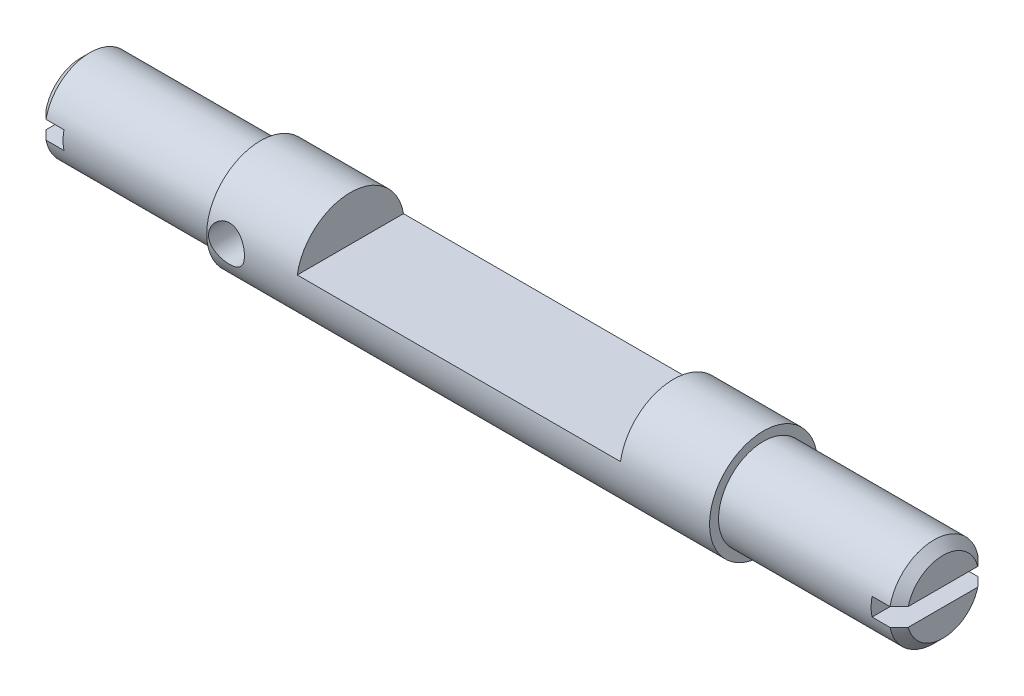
ISO-10303-21;
HEADER;
FILE_DESCRIPTION(('STEP AP214'),'2;1');
FILE_NAME('part.step','',(''),(''),'','','');
FILE_SCHEMA(('AUTOMOTIVE_DESIGN { 1 0 10303 214 1 1 1 1 }'));
ENDSEC;
DATA;
#1=APPLICATION_CONTEXT('core data for automotive mechanical design processes');
#2=APPLICATION_PROTOCOL_DEFINITION('international standard','automotive_design',2000,#1);
#3=PRODUCT_CONTEXT('',#1,'mechanical');
#4=PRODUCT('Part','Part','',(#3));
#5=PRODUCT_RELATED_PRODUCT_CATEGORY('part','',(#4));
#6=PRODUCT_DEFINITION_FORMATION('','',#4);
#7=PRODUCT_DEFINITION_CONTEXT('part definition',#1,'design');
#8=PRODUCT_DEFINITION('design','',#6,#7);
#9=PRODUCT_DEFINITION_SHAPE('','',#8);
#10=(LENGTH_UNIT() NAMED_UNIT(*) SI_UNIT(.MILLI.,.METRE.));
#11=(NAMED_UNIT(*) PLANE_ANGLE_UNIT() SI_UNIT($,.RADIAN.));
#12=(NAMED_UNIT(*) SI_UNIT($,.STERADIAN.) SOLID_ANGLE_UNIT());
#13=UNCERTAINTY_MEASURE_WITH_UNIT(LENGTH_MEASURE(1.E-05),#10,'distance_accuracy_value','');
#14=(GEOMETRIC_REPRESENTATION_CONTEXT(3) GLOBAL_UNCERTAINTY_ASSIGNED_CONTEXT((#13)) GLOBAL_UNIT_ASSIGNED_CONTEXT((#10,
#11,#12)) REPRESENTATION_CONTEXT('',''));
#15=CARTESIAN_POINT('',(0.,0.,0.));
#16=DIRECTION('',(0.,0.,1.));
#17=DIRECTION('',(1.,0.,0.));
#18=AXIS2_PLACEMENT_3D('',#15,#16,#17);
#19=CARTESIAN_POINT('',(24.,0.,0.));
#20=DIRECTION('',(-1.,0.,0.));
#21=DIRECTION('',(0.,0.,1.));
#22=AXIS2_PLACEMENT_3D('',#19,#20,#21);
#23=CONICAL_SURFACE('',#22,2.,0.785398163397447);
#24=CARTESIAN_POINT('',(23.5,0.,0.));
#25=DIRECTION('',(-1.,0.,0.));
#26=DIRECTION('',(0.,0.,1.));
#27=AXIS2_PLACEMENT_3D('',#24,#25,#26);
#28=CIRCLE('',#27,2.5);
#29=CARTESIAN_POINT('',(23.5,-0.499999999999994,-2.44948974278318));
#30=VERTEX_POINT('',#29);
#31=CARTESIAN_POINT('',(23.5,-0.499999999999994,2.44948974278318));
#32=VERTEX_POINT('',#31);
#33=EDGE_CURVE('E620',#30,#32,#28,.T.);
#34=ORIENTED_EDGE('',*,*,#33,.F.);
#35=CARTESIAN_POINT('',(20.4848373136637,-0.499999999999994,-5.49245113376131));
#36=CARTESIAN_POINT('',(20.6810151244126,-0.499999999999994,-5.29545469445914));
#37=CARTESIAN_POINT('',(20.8771564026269,-0.499999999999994,-5.09842181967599));
#38=CARTESIAN_POINT('',(21.2693295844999,-0.499999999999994,-4.70421753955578));
#39=CARTESIAN_POINT('',(21.4653614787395,-0.499999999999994,-4.50704612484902));
#40=CARTESIAN_POINT('',(21.8576041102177,-0.499999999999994,-4.11217229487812));
#41=CARTESIAN_POINT('',(22.0538145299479,-0.499999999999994,-3.91446956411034));
#42=CARTESIAN_POINT('',(22.4459461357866,-0.499999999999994,-3.51880630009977));
#43=CARTESIAN_POINT('',(22.6418673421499,-0.499999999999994,-3.32084578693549));
#44=CARTESIAN_POINT('',(23.0205064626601,-0.499999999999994,-2.93738938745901));
#45=CARTESIAN_POINT('',(23.2032529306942,-0.499999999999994,-2.75192173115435));
#46=CARTESIAN_POINT('',(23.4768542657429,-0.499999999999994,-2.47317064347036));
#47=CARTESIAN_POINT('',(23.5679784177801,-0.499999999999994,-2.38015164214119));
#48=CARTESIAN_POINT('',(23.7499680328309,-0.499999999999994,-2.19386469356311));
#49=CARTESIAN_POINT('',(23.840833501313,-0.499999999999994,-2.10059675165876));
#50=CARTESIAN_POINT('',(24.0220948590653,-0.499999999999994,-1.91379756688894));
#51=CARTESIAN_POINT('',(24.1124911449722,-0.499999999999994,-1.82026670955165));
#52=CARTESIAN_POINT('',(24.292711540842,-0.499999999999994,-1.63264043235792));
#53=CARTESIAN_POINT('',(24.3825356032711,-0.499999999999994,-1.53854496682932));
#54=CARTESIAN_POINT('',(24.5612019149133,-0.499999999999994,-1.34948902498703));
#55=CARTESIAN_POINT('',(24.6500445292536,-0.499999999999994,-1.25452889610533));
#56=CARTESIAN_POINT('',(24.7819510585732,-0.499999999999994,-1.11085234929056));
#57=CARTESIAN_POINT('',(24.8256907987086,-0.499999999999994,-1.06275735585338));
#58=CARTESIAN_POINT('',(24.9125070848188,-0.499999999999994,-0.96597348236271));
#59=CARTESIAN_POINT('',(24.9555836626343,-0.499999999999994,-0.917284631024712));
#60=CARTESIAN_POINT('',(25.021977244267,-0.499999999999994,-0.840663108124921));
#61=CARTESIAN_POINT('',(25.0456420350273,-0.499999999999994,-0.813032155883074));
#62=CARTESIAN_POINT('',(25.0925567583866,-0.499999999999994,-0.757414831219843));
#63=CARTESIAN_POINT('',(25.1158066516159,-0.499999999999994,-0.729428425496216));
#64=CARTESIAN_POINT('',(25.1620286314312,-0.499999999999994,-0.672659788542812));
#65=CARTESIAN_POINT('',(25.1849939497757,-0.499999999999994,-0.643872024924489));
#66=CARTESIAN_POINT('',(25.2301333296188,-0.499999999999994,-0.585689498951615));
#67=CARTESIAN_POINT('',(25.2523075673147,-0.499999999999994,-0.55629487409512));
#68=CARTESIAN_POINT('',(25.2958450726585,-0.499999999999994,-0.496254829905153));
#69=CARTESIAN_POINT('',(25.3171920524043,-0.499999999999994,-0.465597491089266));
#70=CARTESIAN_POINT('',(25.3581875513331,-0.499999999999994,-0.40309071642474));
#71=CARTESIAN_POINT('',(25.3778337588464,-0.499999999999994,-0.371239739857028));
#72=CARTESIAN_POINT('',(25.4141904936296,-0.499999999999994,-0.306407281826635));
#73=CARTESIAN_POINT('',(25.4309356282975,-0.499999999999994,-0.273445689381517));
#74=CARTESIAN_POINT('',(25.4601849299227,-0.499999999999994,-0.205734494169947));
#75=CARTESIAN_POINT('',(25.4727032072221,-0.499999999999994,-0.170991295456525));
#76=CARTESIAN_POINT('',(25.4906219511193,-0.499999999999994,-0.102327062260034));
#77=CARTESIAN_POINT('',(25.4964773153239,-0.499999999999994,-0.0685327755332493));
#78=CARTESIAN_POINT('',(25.501141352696,-0.499999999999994,-0.000520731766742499));
#79=CARTESIAN_POINT('',(25.4999703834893,-0.499999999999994,0.0336955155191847));
#80=CARTESIAN_POINT('',(25.4910097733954,-0.499999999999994,0.100918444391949));
#81=CARTESIAN_POINT('',(25.4832710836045,-0.499999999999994,0.133932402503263));
#82=CARTESIAN_POINT('',(25.4680210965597,-0.499999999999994,0.182318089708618));
#83=CARTESIAN_POINT('',(25.4623075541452,-0.499999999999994,0.198304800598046));
#84=CARTESIAN_POINT('',(25.449876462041,-0.499999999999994,0.229881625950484));
#85=CARTESIAN_POINT('',(25.4431591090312,-0.499999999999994,0.245471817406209));
#86=CARTESIAN_POINT('',(25.4219085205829,-0.499999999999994,0.291422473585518));
#87=CARTESIAN_POINT('',(25.4061859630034,-0.499999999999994,0.321229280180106));
#88=CARTESIAN_POINT('',(25.3726510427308,-0.499999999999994,0.379655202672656));
#89=CARTESIAN_POINT('',(25.3548361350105,-0.499999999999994,0.408272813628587));
#90=CARTESIAN_POINT('',(25.3177421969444,-0.499999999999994,0.464680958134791));
#91=CARTESIAN_POINT('',(25.2984581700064,-0.499999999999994,0.492468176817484));
#92=CARTESIAN_POINT('',(25.2589069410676,-0.499999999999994,0.547337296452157));
#93=CARTESIAN_POINT('',(25.2386395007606,-0.499999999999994,0.574419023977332));
#94=CARTESIAN_POINT('',(25.1763947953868,-0.499999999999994,0.655392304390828));
#95=CARTESIAN_POINT('',(25.1333538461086,-0.499999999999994,0.708462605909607));
#96=CARTESIAN_POINT('',(25.0458374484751,-0.499999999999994,0.813162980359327));
#97=CARTESIAN_POINT('',(25.0013657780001,-0.499999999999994,0.864796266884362));
#98=CARTESIAN_POINT('',(24.912446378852,-0.499999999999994,0.966099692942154));
#99=CARTESIAN_POINT('',(24.8680193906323,-0.499999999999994,1.01578807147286));
#100=CARTESIAN_POINT('',(24.7785560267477,-0.499999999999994,1.11461265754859));
#101=CARTESIAN_POINT('',(24.7335196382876,-0.499999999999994,1.16374885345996));
#102=CARTESIAN_POINT('',(24.5977743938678,-0.499999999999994,1.31059127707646));
#103=CARTESIAN_POINT('',(24.5064405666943,-0.499999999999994,1.40771890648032));
#104=CARTESIAN_POINT('',(24.322777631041,-0.499999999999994,1.6012439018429));
#105=CARTESIAN_POINT('',(24.2304474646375,-0.499999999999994,1.69764025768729));
#106=CARTESIAN_POINT('',(24.0452475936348,-0.499999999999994,1.8899003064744));
#107=CARTESIAN_POINT('',(23.9523779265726,-0.499999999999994,1.98576403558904));
#108=CARTESIAN_POINT('',(23.7671354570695,-0.499999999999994,2.1762746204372));
#109=CARTESIAN_POINT('',(23.6747658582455,-0.499999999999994,2.27092459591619));
#110=CARTESIAN_POINT('',(23.4897851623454,-0.499999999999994,2.4599914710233));
#111=CARTESIAN_POINT('',(23.3971740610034,-0.499999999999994,2.55440836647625));
#112=CARTESIAN_POINT('',(23.1191664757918,-0.499999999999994,2.83732988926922));
#113=CARTESIAN_POINT('',(22.9335171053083,-0.499999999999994,3.0255859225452));
#114=CARTESIAN_POINT('',(22.5603930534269,-0.499999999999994,3.4031934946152));
#115=CARTESIAN_POINT('',(22.3729154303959,-0.499999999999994,3.59254212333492));
#116=CARTESIAN_POINT('',(21.997694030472,-0.499999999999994,3.97102846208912));
#117=CARTESIAN_POINT('',(21.8099502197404,-0.499999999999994,4.16016613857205));
#118=CARTESIAN_POINT('',(21.4326954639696,-0.499999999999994,4.53990596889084));
#119=CARTESIAN_POINT('',(21.243183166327,-0.499999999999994,4.73050677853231));
#120=CARTESIAN_POINT('',(20.8640712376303,-0.499999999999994,5.1115669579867));
#121=CARTESIAN_POINT('',(20.6744716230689,-0.499999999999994,5.30202634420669));
#122=CARTESIAN_POINT('',(20.4848373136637,-0.499999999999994,5.49245113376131));
#123=B_SPLINE_CURVE_WITH_KNOTS('',3,(#35,#36,#37,#38,#39,#40,#41,#42,#43,#44,#45,#46,#47,#48,
#49,#50,#51,#52,#53,#54,#55,#56,#57,#58,#59,#60,#61,#62,#63,#64,#65,#66,#67,#68,#69,#70,#71,#72,
#73,#74,#75,#76,#77,#78,#79,#80,#81,#82,#83,#84,#85,#86,#87,#88,#89,#90,#91,#92,#93,#94,#95,#96,
#97,#98,#99,#100,#101,#102,#103,#104,#105,#106,#107,#108,#109,#110,#111,#112,#113,#114,#115,
#116,#117,#118,#119,#120,#121,#122),.UNSPECIFIED.,.F.,.F.,(4,2,2,2,2,2,2,2,2,2,2,2,2,2,2,2,2,2,
2,2,2,2,2,2,2,2,2,2,2,2,2,2,2,2,2,2,2,2,2,2,2,2,2,4),(0.,0.834050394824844,1.66816401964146,
2.50378580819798,3.33934599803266,4.12046614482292,4.51111308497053,4.90175170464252,
5.29197486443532,5.68223002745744,6.07233475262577,6.2673611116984,6.46237807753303,
6.57151456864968,6.68066136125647,6.79112918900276,6.90157225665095,7.01360660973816,
7.1257909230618,7.23652776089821,7.34689118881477,7.44915617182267,7.55112500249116,
7.65230993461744,7.70321621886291,7.75411254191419,7.85506623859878,7.9561440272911,
8.05758241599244,8.15904550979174,8.36397042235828,8.56839264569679,8.76834485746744,
8.96830127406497,9.36826411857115,9.76870439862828,10.1691171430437,10.5658745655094,
10.9626390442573,11.7558303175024,12.5552091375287,13.3547008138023,14.1610457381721,
14.9672746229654),.UNSPECIFIED.);
#124=CARTESIAN_POINT('',(24.,-0.499999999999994,-1.93649167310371));
#125=VERTEX_POINT('',#124);
#126=EDGE_CURVE('E499',#30,#125,#123,.T.);
#127=ORIENTED_EDGE('',*,*,#126,.T.);
#128=CARTESIAN_POINT('',(24.,0.,0.));
#129=DIRECTION('',(-1.,0.,0.));
#130=DIRECTION('',(0.,0.,1.));
#131=AXIS2_PLACEMENT_3D('',#128,#129,#130);
#132=CIRCLE('',#131,2.);
#133=CARTESIAN_POINT('',(24.,-0.499999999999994,1.93649167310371));
#134=VERTEX_POINT('',#133);
#135=EDGE_CURVE('E623',#125,#134,#132,.T.);
#136=ORIENTED_EDGE('',*,*,#135,.T.);
#137=EDGE_CURVE('E491',#134,#32,#123,.T.);
#138=ORIENTED_EDGE('',*,*,#137,.T.);
#139=EDGE_LOOP('',(#34,#127,#136,#138));
#140=FACE_BOUND('',#139,.T.);
#141=ADVANCED_FACE('F353',(#140),#23,.T.);
#142=CARTESIAN_POINT('',(24.,2.,0.));
#143=DIRECTION('',(-1.,0.,0.));
#144=DIRECTION('',(0.,0.,1.));
#145=AXIS2_PLACEMENT_3D('',#142,#143,#144);
#146=PLANE('',#145);
#147=ORIENTED_EDGE('',*,*,#135,.F.);
#148=DIRECTION('',(0.,0.,1.));
#149=VECTOR('',#148,1.);
#150=CARTESIAN_POINT('',(24.,-0.499999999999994,0.));
#151=LINE('',#150,#149);
#152=EDGE_CURVE('E567',#125,#134,#151,.T.);
#153=ORIENTED_EDGE('',*,*,#152,.T.);
#154=EDGE_LOOP('',(#147,#153));
#155=FACE_BOUND('',#154,.T.);
#156=ADVANCED_FACE('F656',(#155),#146,.F.);
#157=CARTESIAN_POINT('',(-24.,0.,0.));
#158=DIRECTION('',(1.,0.,0.));
#159=DIRECTION('',(0.,0.,-1.));
#160=AXIS2_PLACEMENT_3D('',#157,#158,#159);
#161=PLANE('',#160);
#162=CARTESIAN_POINT('',(-24.,0.,0.));
#163=DIRECTION('',(-1.,0.,0.));
#164=DIRECTION('',(0.,0.,1.));
#165=AXIS2_PLACEMENT_3D('',#162,#163,#164);
#166=CIRCLE('',#165,2.);
#167=CARTESIAN_POINT('',(-24.,0.5,1.93649167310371));
#168=VERTEX_POINT('',#167);
#169=CARTESIAN_POINT('',(-24.,0.5,-1.93649167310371));
#170=VERTEX_POINT('',#169);
#171=EDGE_CURVE('E599',#168,#170,#166,.T.);
#172=ORIENTED_EDGE('',*,*,#171,.T.);
#173=DIRECTION('',(0.,0.,1.));
#174=VECTOR('',#173,1.);
#175=CARTESIAN_POINT('',(-24.,0.5,-3.));
#176=LINE('',#175,#174);
#177=EDGE_CURVE('E637',#170,#168,#176,.T.);
#178=ORIENTED_EDGE('',*,*,#177,.T.);
#179=EDGE_LOOP('',(#172,#178));
#180=FACE_BOUND('',#179,.T.);
#181=ADVANCED_FACE('F636',(#180),#161,.F.);
#182=CARTESIAN_POINT('',(-23.5,0.,0.));
#183=DIRECTION('',(1.,0.,0.));
#184=DIRECTION('',(0.,0.,-1.));
#185=AXIS2_PLACEMENT_3D('',#182,#183,#184);
#186=CONICAL_SURFACE('',#185,2.5,0.785398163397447);
#187=CARTESIAN_POINT('',(-23.5,0.,0.));
#188=DIRECTION('',(-1.,0.,0.));
#189=DIRECTION('',(0.,0.,1.));
#190=AXIS2_PLACEMENT_3D('',#187,#188,#189);
#191=CIRCLE('',#190,2.5);
#192=CARTESIAN_POINT('',(-23.5,0.500000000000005,2.44948974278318));
#193=VERTEX_POINT('',#192);
#194=CARTESIAN_POINT('',(-23.5,0.500000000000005,-2.44948974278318));
#195=VERTEX_POINT('',#194);
#196=EDGE_CURVE('E603',#193,#195,#191,.T.);
#197=ORIENTED_EDGE('',*,*,#196,.T.);
#198=CARTESIAN_POINT('',(-20.4848373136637,0.499999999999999,-5.4924511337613));
#199=CARTESIAN_POINT('',(-20.6810151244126,0.499999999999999,-5.29545469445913));
#200=CARTESIAN_POINT('',(-20.8771564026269,0.5,-5.09842181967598));
#201=CARTESIAN_POINT('',(-21.2693295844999,0.5,-4.70421753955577));
#202=CARTESIAN_POINT('',(-21.4653614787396,0.5,-4.50704612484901));
#203=CARTESIAN_POINT('',(-21.8576041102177,0.5,-4.11217229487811));
#204=CARTESIAN_POINT('',(-22.053814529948,0.5,-3.91446956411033));
#205=CARTESIAN_POINT('',(-22.4459461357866,0.5,-3.51880630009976));
#206=CARTESIAN_POINT('',(-22.6418673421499,0.5,-3.32084578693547));
#207=CARTESIAN_POINT('',(-23.0205064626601,0.5,-2.93738938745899));
#208=CARTESIAN_POINT('',(-23.2032529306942,0.5,-2.75192173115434));
#209=CARTESIAN_POINT('',(-23.4768542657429,0.5,-2.47317064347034));
#210=CARTESIAN_POINT('',(-23.5679784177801,0.5,-2.38015164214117));
#211=CARTESIAN_POINT('',(-23.7499680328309,0.5,-2.1938646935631));
#212=CARTESIAN_POINT('',(-23.840833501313,0.5,-2.10059675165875));
#213=CARTESIAN_POINT('',(-24.0220948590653,0.5,-1.91379756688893));
#214=CARTESIAN_POINT('',(-24.1124911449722,0.5,-1.82026670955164));
#215=CARTESIAN_POINT('',(-24.292711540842,0.5,-1.63264043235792));
#216=CARTESIAN_POINT('',(-24.3825356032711,0.5,-1.53854496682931));
#217=CARTESIAN_POINT('',(-24.5612019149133,0.5,-1.34948902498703));
#218=CARTESIAN_POINT('',(-24.6500445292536,0.5,-1.25452889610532));
#219=CARTESIAN_POINT('',(-24.7819510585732,0.5,-1.11085234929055));
#220=CARTESIAN_POINT('',(-24.8256907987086,0.5,-1.06275735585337));
#221=CARTESIAN_POINT('',(-24.9125070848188,0.5,-0.965973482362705));
#222=CARTESIAN_POINT('',(-24.9555836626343,0.5,-0.917284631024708));
#223=CARTESIAN_POINT('',(-25.021977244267,0.5,-0.840663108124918));
#224=CARTESIAN_POINT('',(-25.0456420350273,0.5,-0.813032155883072));
#225=CARTESIAN_POINT('',(-25.0925567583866,0.5,-0.757414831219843));
#226=CARTESIAN_POINT('',(-25.1158066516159,0.5,-0.729428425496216));
#227=CARTESIAN_POINT('',(-25.1620286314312,0.5,-0.672659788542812));
#228=CARTESIAN_POINT('',(-25.1849939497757,0.5,-0.643872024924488));
#229=CARTESIAN_POINT('',(-25.2301333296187,0.5,-0.585689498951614));
#230=CARTESIAN_POINT('',(-25.2523075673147,0.5,-0.556294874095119));
#231=CARTESIAN_POINT('',(-25.2958450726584,0.5,-0.496254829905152));
#232=CARTESIAN_POINT('',(-25.3171920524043,0.5,-0.465597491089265));
#233=CARTESIAN_POINT('',(-25.3581875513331,0.5,-0.40309071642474));
#234=CARTESIAN_POINT('',(-25.3778337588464,0.5,-0.371239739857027));
#235=CARTESIAN_POINT('',(-25.4141904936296,0.5,-0.306407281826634));
#236=CARTESIAN_POINT('',(-25.4309356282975,0.5,-0.273445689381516));
#237=CARTESIAN_POINT('',(-25.4601849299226,0.5,-0.205734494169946));
#238=CARTESIAN_POINT('',(-25.472703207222,0.5,-0.170991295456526));
#239=CARTESIAN_POINT('',(-25.4906219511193,0.5,-0.102327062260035));
#240=CARTESIAN_POINT('',(-25.4964773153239,0.5,-0.0685327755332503));
#241=CARTESIAN_POINT('',(-25.501141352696,0.5,-0.000520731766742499));
#242=CARTESIAN_POINT('',(-25.4999703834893,0.5,0.0336955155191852));
#243=CARTESIAN_POINT('',(-25.4910097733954,0.5,0.100918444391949));
#244=CARTESIAN_POINT('',(-25.4832710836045,0.5,0.133932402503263));
#245=CARTESIAN_POINT('',(-25.4680210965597,0.5,0.182318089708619));
#246=CARTESIAN_POINT('',(-25.4623075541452,0.5,0.198304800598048));
#247=CARTESIAN_POINT('',(-25.4498764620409,0.5,0.229881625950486));
#248=CARTESIAN_POINT('',(-25.4431591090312,0.5,0.245471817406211));
#249=CARTESIAN_POINT('',(-25.4219085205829,0.5,0.291422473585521));
#250=CARTESIAN_POINT('',(-25.4061859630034,0.5,0.321229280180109));
#251=CARTESIAN_POINT('',(-25.3726510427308,0.5,0.379655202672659));
#252=CARTESIAN_POINT('',(-25.3548361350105,0.5,0.408272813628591));
#253=CARTESIAN_POINT('',(-25.3177421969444,0.5,0.464680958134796));
#254=CARTESIAN_POINT('',(-25.2984581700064,0.5,0.492468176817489));
#255=CARTESIAN_POINT('',(-25.2589069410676,0.5,0.547337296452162));
#256=CARTESIAN_POINT('',(-25.2386395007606,0.5,0.574419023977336));
#257=CARTESIAN_POINT('',(-25.1763947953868,0.5,0.655392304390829));
#258=CARTESIAN_POINT('',(-25.1333538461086,0.5,0.708462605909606));
#259=CARTESIAN_POINT('',(-25.0458374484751,0.5,0.813162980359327));
#260=CARTESIAN_POINT('',(-25.0013657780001,0.5,0.864796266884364));
#261=CARTESIAN_POINT('',(-24.9124463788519,0.5,0.966099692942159));
#262=CARTESIAN_POINT('',(-24.8680193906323,0.5,1.01578807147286));
#263=CARTESIAN_POINT('',(-24.7785560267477,0.5,1.1146126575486));
#264=CARTESIAN_POINT('',(-24.7335196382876,0.5,1.16374885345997));
#265=CARTESIAN_POINT('',(-24.5977743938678,0.5,1.31059127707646));
#266=CARTESIAN_POINT('',(-24.5064405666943,0.5,1.40771890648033));
#267=CARTESIAN_POINT('',(-24.322777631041,0.5,1.6012439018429));
#268=CARTESIAN_POINT('',(-24.2304474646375,0.5,1.6976402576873));
#269=CARTESIAN_POINT('',(-24.0452475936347,0.5,1.88990030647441));
#270=CARTESIAN_POINT('',(-23.9523779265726,0.5,1.98576403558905));
#271=CARTESIAN_POINT('',(-23.7671354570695,0.5,2.17627462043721));
#272=CARTESIAN_POINT('',(-23.6747658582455,0.5,2.2709245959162));
#273=CARTESIAN_POINT('',(-23.4897851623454,0.5,2.45999147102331));
#274=CARTESIAN_POINT('',(-23.3971740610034,0.5,2.55440836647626));
#275=CARTESIAN_POINT('',(-23.1191664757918,0.5,2.83732988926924));
#276=CARTESIAN_POINT('',(-22.9335171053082,0.5,3.02558592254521));
#277=CARTESIAN_POINT('',(-22.5603930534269,0.5,3.40319349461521));
#278=CARTESIAN_POINT('',(-22.3729154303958,0.5,3.59254212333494));
#279=CARTESIAN_POINT('',(-21.997694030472,0.5,3.97102846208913));
#280=CARTESIAN_POINT('',(-21.8099502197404,0.5,4.16016613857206));
#281=CARTESIAN_POINT('',(-21.4326954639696,0.5,4.53990596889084));
#282=CARTESIAN_POINT('',(-21.243183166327,0.5,4.73050677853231));
#283=CARTESIAN_POINT('',(-20.8640712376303,0.5,5.11156695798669));
#284=CARTESIAN_POINT('',(-20.6744716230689,0.499999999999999,5.30202634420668));
#285=CARTESIAN_POINT('',(-20.4848373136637,0.499999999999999,5.4924511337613));
#286=B_SPLINE_CURVE_WITH_KNOTS('',3,(#198,#199,#200,#201,#202,#203,#204,#205,#206,#207,#208,
#209,#210,#211,#212,#213,#214,#215,#216,#217,#218,#219,#220,#221,#222,#223,#224,#225,#226,#227,
#228,#229,#230,#231,#232,#233,#234,#235,#236,#237,#238,#239,#240,#241,#242,#243,#244,#245,#246,
#247,#248,#249,#250,#251,#252,#253,#254,#255,#256,#257,#258,#259,#260,#261,#262,#263,#264,#265,
#266,#267,#268,#269,#270,#271,#272,#273,#274,#275,#276,#277,#278,#279,#280,#281,#282,#283,#284,
#285),.UNSPECIFIED.,.F.,.F.,(4,2,2,2,2,2,2,2,2,2,2,2,2,2,2,2,2,2,2,2,2,2,2,2,2,2,2,2,2,2,2,2,2,
2,2,2,2,2,2,2,2,2,2,4),(0.,0.834050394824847,1.66816401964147,2.50378580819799,3.33934599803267,
4.12046614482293,4.51111308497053,4.90175170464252,5.29197486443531,5.68223002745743,
6.07233475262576,6.26736111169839,6.46237807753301,6.57151456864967,6.68066136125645,
6.79112918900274,6.90157225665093,7.01360660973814,7.12579092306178,7.23652776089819,
7.34689118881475,7.44915617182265,7.55112500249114,7.65230993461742,7.70321621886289,
7.75411254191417,7.85506623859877,7.95614402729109,8.05758241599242,8.15904550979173,
8.36397042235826,8.56839264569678,8.76834485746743,8.96830127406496,9.36826411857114,
9.76870439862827,10.1691171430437,10.5658745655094,10.9626390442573,11.7558303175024,
12.5552091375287,13.3547008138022,14.1610457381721,14.9672746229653),.UNSPECIFIED.);
#287=EDGE_CURVE('E533',#195,#170,#286,.T.);
#288=ORIENTED_EDGE('',*,*,#287,.T.);
#289=ORIENTED_EDGE('',*,*,#171,.F.);
#290=EDGE_CURVE('E526',#168,#193,#286,.T.);
#291=ORIENTED_EDGE('',*,*,#290,.T.);
#292=EDGE_LOOP('',(#197,#288,#289,#291));
#293=FACE_BOUND('',#292,.T.);
#294=ADVANCED_FACE('F548',(#293),#186,.T.);
#295=CARTESIAN_POINT('',(-24.,-0.500000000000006,-1.93649167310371));
#296=VERTEX_POINT('',#295);
#297=CARTESIAN_POINT('',(-24.,-0.500000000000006,1.93649167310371));
#298=VERTEX_POINT('',#297);
#299=EDGE_CURVE('E602',#296,#298,#166,.T.);
#300=ORIENTED_EDGE('',*,*,#299,.T.);
#301=DIRECTION('',(0.,0.,1.));
#302=VECTOR('',#301,1.);
#303=CARTESIAN_POINT('',(-24.,-0.500000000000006,-3.));
#304=LINE('',#303,#302);
#305=EDGE_CURVE('E645',#296,#298,#304,.T.);
#306=ORIENTED_EDGE('',*,*,#305,.F.);
#307=EDGE_LOOP('',(#300,#306));
#308=FACE_BOUND('',#307,.T.);
#309=ADVANCED_FACE('F355',(#308),#161,.F.);
#310=CARTESIAN_POINT('',(-23.5,-0.500000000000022,-2.44948974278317));
#311=VERTEX_POINT('',#310);
#312=CARTESIAN_POINT('',(-23.5,-0.500000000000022,2.44948974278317));
#313=VERTEX_POINT('',#312);
#314=EDGE_CURVE('E606',#311,#313,#191,.T.);
#315=ORIENTED_EDGE('',*,*,#314,.T.);
#316=CARTESIAN_POINT('',(-20.4848373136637,-0.500000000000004,5.49245113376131));
#317=CARTESIAN_POINT('',(-20.6810151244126,-0.500000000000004,5.29545469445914));
#318=CARTESIAN_POINT('',(-20.8771564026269,-0.500000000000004,5.09842181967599));
#319=CARTESIAN_POINT('',(-21.2693295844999,-0.500000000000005,4.70421753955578));
#320=CARTESIAN_POINT('',(-21.4653614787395,-0.500000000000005,4.50704612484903));
#321=CARTESIAN_POINT('',(-21.8576041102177,-0.500000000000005,4.11217229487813));
#322=CARTESIAN_POINT('',(-22.0538145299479,-0.500000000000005,3.91446956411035));
#323=CARTESIAN_POINT('',(-22.4459461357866,-0.500000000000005,3.51880630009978));
#324=CARTESIAN_POINT('',(-22.6418673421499,-0.500000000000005,3.3208457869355));
#325=CARTESIAN_POINT('',(-23.02050646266,-0.500000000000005,2.93738938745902));
#326=CARTESIAN_POINT('',(-23.2032529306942,-0.500000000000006,2.75192173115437));
#327=CARTESIAN_POINT('',(-23.4768542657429,-0.500000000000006,2.47317064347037));
#328=CARTESIAN_POINT('',(-23.5679784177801,-0.500000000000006,2.3801516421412));
#329=CARTESIAN_POINT('',(-23.7499680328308,-0.500000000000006,2.19386469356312));
#330=CARTESIAN_POINT('',(-23.840833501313,-0.500000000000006,2.10059675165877));
#331=CARTESIAN_POINT('',(-24.0220948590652,-0.500000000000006,1.91379756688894));
#332=CARTESIAN_POINT('',(-24.1124911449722,-0.500000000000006,1.82026670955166));
#333=CARTESIAN_POINT('',(-24.2927115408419,-0.500000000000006,1.63264043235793));
#334=CARTESIAN_POINT('',(-24.3825356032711,-0.500000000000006,1.53854496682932));
#335=CARTESIAN_POINT('',(-24.5612019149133,-0.500000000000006,1.34948902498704));
#336=CARTESIAN_POINT('',(-24.6500445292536,-0.500000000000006,1.25452889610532));
#337=CARTESIAN_POINT('',(-24.7819510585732,-0.500000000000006,1.11085234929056));
#338=CARTESIAN_POINT('',(-24.8256907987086,-0.500000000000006,1.06275735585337));
#339=CARTESIAN_POINT('',(-24.9125070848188,-0.500000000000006,0.965973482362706));
#340=CARTESIAN_POINT('',(-24.9555836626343,-0.500000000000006,0.917284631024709));
#341=CARTESIAN_POINT('',(-25.021977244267,-0.500000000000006,0.840663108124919));
#342=CARTESIAN_POINT('',(-25.0456420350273,-0.500000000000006,0.813032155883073));
#343=CARTESIAN_POINT('',(-25.0925567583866,-0.500000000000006,0.757414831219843));
#344=CARTESIAN_POINT('',(-25.1158066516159,-0.500000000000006,0.729428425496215));
#345=CARTESIAN_POINT('',(-25.1620286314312,-0.500000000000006,0.672659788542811));
#346=CARTESIAN_POINT('',(-25.1849939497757,-0.500000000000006,0.643872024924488));
#347=CARTESIAN_POINT('',(-25.2301333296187,-0.500000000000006,0.585689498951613));
#348=CARTESIAN_POINT('',(-25.2523075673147,-0.500000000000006,0.556294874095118));
#349=CARTESIAN_POINT('',(-25.2958450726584,-0.500000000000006,0.496254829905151));
#350=CARTESIAN_POINT('',(-25.3171920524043,-0.500000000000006,0.465597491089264));
#351=CARTESIAN_POINT('',(-25.3581875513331,-0.500000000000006,0.403090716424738));
#352=CARTESIAN_POINT('',(-25.3778337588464,-0.500000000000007,0.371239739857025));
#353=CARTESIAN_POINT('',(-25.4141904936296,-0.500000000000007,0.306407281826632));
#354=CARTESIAN_POINT('',(-25.4309356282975,-0.500000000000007,0.273445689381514));
#355=CARTESIAN_POINT('',(-25.4601849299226,-0.500000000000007,0.205734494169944));
#356=CARTESIAN_POINT('',(-25.472703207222,-0.500000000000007,0.170991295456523));
#357=CARTESIAN_POINT('',(-25.4906219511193,-0.500000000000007,0.102327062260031));
#358=CARTESIAN_POINT('',(-25.4964773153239,-0.500000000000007,0.0685327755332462));
#359=CARTESIAN_POINT('',(-25.501141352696,-0.500000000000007,0.000520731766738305));
#360=CARTESIAN_POINT('',(-25.4999703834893,-0.500000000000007,-0.0336955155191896));
#361=CARTESIAN_POINT('',(-25.4910097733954,-0.500000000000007,-0.100918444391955));
#362=CARTESIAN_POINT('',(-25.4832710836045,-0.500000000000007,-0.133932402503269));
#363=CARTESIAN_POINT('',(-25.4680210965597,-0.500000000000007,-0.182318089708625));
#364=CARTESIAN_POINT('',(-25.4623075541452,-0.500000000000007,-0.198304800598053));
#365=CARTESIAN_POINT('',(-25.4498764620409,-0.500000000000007,-0.229881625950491));
#366=CARTESIAN_POINT('',(-25.4431591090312,-0.500000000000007,-0.245471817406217));
#367=CARTESIAN_POINT('',(-25.4219085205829,-0.500000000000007,-0.291422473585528));
#368=CARTESIAN_POINT('',(-25.4061859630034,-0.500000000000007,-0.321229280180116));
#369=CARTESIAN_POINT('',(-25.3726510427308,-0.500000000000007,-0.379655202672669));
#370=CARTESIAN_POINT('',(-25.3548361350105,-0.500000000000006,-0.408272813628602));
#371=CARTESIAN_POINT('',(-25.3177421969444,-0.500000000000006,-0.46468095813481));
#372=CARTESIAN_POINT('',(-25.2984581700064,-0.500000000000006,-0.492468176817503));
#373=CARTESIAN_POINT('',(-25.2589069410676,-0.500000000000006,-0.547337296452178));
#374=CARTESIAN_POINT('',(-25.2386395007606,-0.500000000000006,-0.574419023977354));
#375=CARTESIAN_POINT('',(-25.1763947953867,-0.500000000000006,-0.65539230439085));
#376=CARTESIAN_POINT('',(-25.1333538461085,-0.500000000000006,-0.708462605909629));
#377=CARTESIAN_POINT('',(-25.0458374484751,-0.500000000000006,-0.813162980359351));
#378=CARTESIAN_POINT('',(-25.0013657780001,-0.500000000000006,-0.864796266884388));
#379=CARTESIAN_POINT('',(-24.9124463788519,-0.500000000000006,-0.966099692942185));
#380=CARTESIAN_POINT('',(-24.8680193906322,-0.500000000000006,-1.01578807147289));
#381=CARTESIAN_POINT('',(-24.7785560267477,-0.500000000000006,-1.11461265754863));
#382=CARTESIAN_POINT('',(-24.7335196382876,-0.500000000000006,-1.16374885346));
#383=CARTESIAN_POINT('',(-24.5977743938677,-0.500000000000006,-1.3105912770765));
#384=CARTESIAN_POINT('',(-24.5064405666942,-0.500000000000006,-1.40771890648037));
#385=CARTESIAN_POINT('',(-24.322777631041,-0.500000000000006,-1.60124390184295));
#386=CARTESIAN_POINT('',(-24.2304474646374,-0.500000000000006,-1.69764025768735));
#387=CARTESIAN_POINT('',(-24.0452475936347,-0.500000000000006,-1.88990030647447));
#388=CARTESIAN_POINT('',(-23.9523779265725,-0.500000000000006,-1.98576403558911));
#389=CARTESIAN_POINT('',(-23.7671354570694,-0.500000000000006,-2.17627462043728));
#390=CARTESIAN_POINT('',(-23.6747658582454,-0.500000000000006,-2.27092459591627));
#391=CARTESIAN_POINT('',(-23.4897851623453,-0.500000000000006,-2.45999147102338));
#392=CARTESIAN_POINT('',(-23.3971740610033,-0.500000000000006,-2.55440836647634));
#393=CARTESIAN_POINT('',(-23.1191664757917,-0.500000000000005,-2.83732988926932));
#394=CARTESIAN_POINT('',(-22.9335171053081,-0.500000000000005,-3.02558592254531));
#395=CARTESIAN_POINT('',(-22.5603930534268,-0.500000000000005,-3.40319349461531));
#396=CARTESIAN_POINT('',(-22.3729154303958,-0.500000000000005,-3.59254212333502));
#397=CARTESIAN_POINT('',(-21.997694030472,-0.500000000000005,-3.9710284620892));
#398=CARTESIAN_POINT('',(-21.8099502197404,-0.500000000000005,-4.16016613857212));
#399=CARTESIAN_POINT('',(-21.4326954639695,-0.500000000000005,-4.53990596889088));
#400=CARTESIAN_POINT('',(-21.243183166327,-0.500000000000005,-4.73050677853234));
#401=CARTESIAN_POINT('',(-20.8640712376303,-0.500000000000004,-5.11156695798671));
#402=CARTESIAN_POINT('',(-20.6744716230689,-0.500000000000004,-5.30202634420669));
#403=CARTESIAN_POINT('',(-20.4848373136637,-0.500000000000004,-5.4924511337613));
#404=B_SPLINE_CURVE_WITH_KNOTS('',3,(#316,#317,#318,#319,#320,#321,#322,#323,#324,#325,#326,
#327,#328,#329,#330,#331,#332,#333,#334,#335,#336,#337,#338,#339,#340,#341,#342,#343,#344,#345,
#346,#347,#348,#349,#350,#351,#352,#353,#354,#355,#356,#357,#358,#359,#360,#361,#362,#363,#364,
#365,#366,#367,#368,#369,#370,#371,#372,#373,#374,#375,#376,#377,#378,#379,#380,#381,#382,#383,
#384,#385,#386,#387,#388,#389,#390,#391,#392,#393,#394,#395,#396,#397,#398,#399,#400,#401,#402,
#403),.UNSPECIFIED.,.F.,.F.,(4,2,2,2,2,2,2,2,2,2,2,2,2,2,2,2,2,2,2,2,2,2,2,2,2,2,2,2,2,2,2,2,2,
2,2,2,2,2,2,2,2,2,2,4),(0.,0.834050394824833,1.66816401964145,2.50378580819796,3.33934599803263,
4.1204661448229,4.5111130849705,4.9017517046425,5.29197486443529,5.68223002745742,
6.07233475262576,6.26736111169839,6.46237807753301,6.57151456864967,6.68066136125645,
6.79112918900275,6.90157225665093,7.01360660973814,7.12579092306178,7.23652776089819,
7.34689118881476,7.44915617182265,7.55112500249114,7.65230993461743,7.70321621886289,
7.75411254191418,7.85506623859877,7.9561440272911,8.05758241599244,8.15904550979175,
8.36397042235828,8.56839264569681,8.76834485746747,8.968301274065,9.36826411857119,
9.76870439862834,10.1691171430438,10.5658745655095,10.9626390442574,11.7558303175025,
12.5552091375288,13.3547008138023,14.1610457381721,14.9672746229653),.UNSPECIFIED.);
#405=EDGE_CURVE('E534',#313,#298,#404,.T.);
#406=ORIENTED_EDGE('',*,*,#405,.T.);
#407=ORIENTED_EDGE('',*,*,#299,.F.);
#408=EDGE_CURVE('E535',#296,#311,#404,.T.);
#409=ORIENTED_EDGE('',*,*,#408,.T.);
#410=EDGE_LOOP('',(#315,#406,#407,#409));
#411=FACE_BOUND('',#410,.T.);
#412=ADVANCED_FACE('F542',(#411),#186,.T.);
#413=CARTESIAN_POINT('',(-61.7557939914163,0.,0.));
#414=DIRECTION('',(-1.,0.,0.));
#415=DIRECTION('',(0.,0.,1.));
#416=AXIS2_PLACEMENT_3D('',#413,#414,#415);
#417=CYLINDRICAL_SURFACE('',#416,2.5);
#418=ORIENTED_EDGE('',*,*,#196,.F.);
#419=DIRECTION('',(-1.,0.,0.));
#420=VECTOR('',#419,1.);
#421=CARTESIAN_POINT('',(-61.7557939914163,0.500000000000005,2.44948974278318));
#422=LINE('',#421,#420);
#423=CARTESIAN_POINT('',(-22.5,0.5,2.44948974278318));
#424=VERTEX_POINT('',#423);
#425=EDGE_CURVE('E572',#193,#424,#422,.F.);
#426=ORIENTED_EDGE('',*,*,#425,.T.);
#427=CARTESIAN_POINT('',(-22.5,0.,0.));
#428=DIRECTION('',(1.,0.,0.));
#429=DIRECTION('',(0.,0.,-1.));
#430=AXIS2_PLACEMENT_3D('',#427,#428,#429);
#431=CIRCLE('',#430,2.5);
#432=CARTESIAN_POINT('',(-22.5,-0.500000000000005,2.44948974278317));
#433=VERTEX_POINT('',#432);
#434=EDGE_CURVE('E575',#424,#433,#431,.T.);
#435=ORIENTED_EDGE('',*,*,#434,.T.);
#436=DIRECTION('',(-1.,0.,0.));
#437=VECTOR('',#436,1.);
#438=CARTESIAN_POINT('',(-61.7557939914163,-0.500000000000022,2.44948974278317));
#439=LINE('',#438,#437);
#440=EDGE_CURVE('E576',#433,#313,#439,.T.);
#441=ORIENTED_EDGE('',*,*,#440,.T.);
#442=ORIENTED_EDGE('',*,*,#314,.F.);
#443=DIRECTION('',(-1.,0.,0.));
#444=VECTOR('',#443,1.);
#445=CARTESIAN_POINT('',(-61.7557939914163,-0.500000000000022,-2.44948974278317));
#446=LINE('',#445,#444);
#447=CARTESIAN_POINT('',(-22.5,-0.500000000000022,-2.44948974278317));
#448=VERTEX_POINT('',#447);
#449=EDGE_CURVE('E585',#311,#448,#446,.F.);
#450=ORIENTED_EDGE('',*,*,#449,.T.);
#451=CARTESIAN_POINT('',(-22.5,0.5,-2.44948974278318));
#452=VERTEX_POINT('',#451);
#453=EDGE_CURVE('E582',#448,#452,#431,.T.);
#454=ORIENTED_EDGE('',*,*,#453,.T.);
#455=DIRECTION('',(-1.,0.,0.));
#456=VECTOR('',#455,1.);
#457=CARTESIAN_POINT('',(-61.7557939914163,0.500000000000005,-2.44948974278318));
#458=LINE('',#457,#456);
#459=EDGE_CURVE('E579',#452,#195,#458,.T.);
#460=ORIENTED_EDGE('',*,*,#459,.T.);
#461=EDGE_LOOP('',(#418,#426,#435,#441,#442,#450,#454,#460));
#462=FACE_BOUND('',#461,.T.);
#463=CARTESIAN_POINT('',(-14.,0.,0.));
#464=DIRECTION('',(-1.,0.,0.));
#465=DIRECTION('',(0.,0.,1.));
#466=AXIS2_PLACEMENT_3D('',#463,#464,#465);
#467=CIRCLE('',#466,2.5);
#468=CARTESIAN_POINT('',(-14.,0.,2.5));
#469=VERTEX_POINT('',#468);
#470=EDGE_CURVE('E607',#469,#469,#467,.T.);
#471=ORIENTED_EDGE('',*,*,#470,.T.);
#472=EDGE_LOOP('',(#471));
#473=FACE_BOUND('',#472,.T.);
#474=ADVANCED_FACE('F546',(#462,#473),#417,.T.);
#475=CARTESIAN_POINT('',(-14.,2.5,0.));
#476=DIRECTION('',(1.,0.,0.));
#477=DIRECTION('',(0.,0.,-1.));
#478=AXIS2_PLACEMENT_3D('',#475,#476,#477);
#479=PLANE('',#478);
#480=ORIENTED_EDGE('',*,*,#470,.F.);
#481=EDGE_LOOP('',(#480));
#482=FACE_BOUND('',#481,.T.);
#483=CARTESIAN_POINT('',(-14.,0.,0.));
#484=DIRECTION('',(-1.,0.,0.));
#485=DIRECTION('',(0.,0.,1.));
#486=AXIS2_PLACEMENT_3D('',#483,#484,#485);
#487=CIRCLE('',#486,3.);
#488=CARTESIAN_POINT('',(-14.,0.,3.));
#489=VERTEX_POINT('',#488);
#490=EDGE_CURVE('E610',#489,#489,#487,.T.);
#491=ORIENTED_EDGE('',*,*,#490,.T.);
#492=EDGE_LOOP('',(#491));
#493=FACE_BOUND('',#492,.T.);
#494=ADVANCED_FACE('F552',(#482,#493),#479,.F.);
#495=CARTESIAN_POINT('',(-61.7557939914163,0.,0.));
#496=DIRECTION('',(-1.,0.,0.));
#497=DIRECTION('',(0.,0.,1.));
#498=AXIS2_PLACEMENT_3D('',#495,#496,#497);
#499=CYLINDRICAL_SURFACE('',#498,3.);
#500=CARTESIAN_POINT('',(-11.9,0.,-3.));
#501=CARTESIAN_POINT('',(-11.8999997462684,0.0545633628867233,-3.00000015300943));
#502=CARTESIAN_POINT('',(-11.9044802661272,0.10912519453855,-2.99849769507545));
#503=CARTESIAN_POINT('',(-11.9222291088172,0.216641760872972,-2.99265210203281));
#504=CARTESIAN_POINT('',(-11.9354983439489,0.269596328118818,-2.98830867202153));
#505=CARTESIAN_POINT('',(-11.970319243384,0.372332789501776,-2.97725307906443));
#506=CARTESIAN_POINT('',(-11.9918570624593,0.422119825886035,-2.97054487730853));
#507=CARTESIAN_POINT('',(-12.0425411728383,0.517374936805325,-2.95544445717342));
#508=CARTESIAN_POINT('',(-12.0716889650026,0.562842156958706,-2.94705190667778));
#509=CARTESIAN_POINT('',(-12.1378258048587,0.649741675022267,-2.92914094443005));
#510=CARTESIAN_POINT('',(-12.1750312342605,0.69100370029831,-2.91959556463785));
#511=CARTESIAN_POINT('',(-12.2557671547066,0.766832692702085,-2.90060314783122));
#512=CARTESIAN_POINT('',(-12.2992990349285,0.801398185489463,-2.89115613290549));
#513=CARTESIAN_POINT('',(-12.3929851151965,0.86382494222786,-2.87313332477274));
#514=CARTESIAN_POINT('',(-12.4432937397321,0.891464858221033,-2.86459039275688));
#515=CARTESIAN_POINT('',(-12.5481760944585,0.937818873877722,-2.84975305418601));
#516=CARTESIAN_POINT('',(-12.6027485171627,0.956535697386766,-2.84345796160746));
#517=CARTESIAN_POINT('',(-12.7126732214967,0.983873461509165,-2.83411303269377));
#518=CARTESIAN_POINT('',(-12.7679372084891,0.992813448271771,-2.83096095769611));
#519=CARTESIAN_POINT('',(-12.8792637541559,1.00134112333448,-2.82795656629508));
#520=CARTESIAN_POINT('',(-12.9353260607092,1.00093170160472,-2.8281032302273));
#521=CARTESIAN_POINT('',(-13.043936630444,0.99101990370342,-2.8315901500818));
#522=CARTESIAN_POINT('',(-13.096528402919,0.981933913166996,-2.83478415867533));
#523=CARTESIAN_POINT('',(-13.1993934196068,0.955606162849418,-2.84376657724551));
#524=CARTESIAN_POINT('',(-13.2496663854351,0.938363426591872,-2.84955529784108));
#525=CARTESIAN_POINT('',(-13.3474127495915,0.895939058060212,-2.86317911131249));
#526=CARTESIAN_POINT('',(-13.3948280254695,0.870634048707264,-2.87104565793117));
#527=CARTESIAN_POINT('',(-13.4848709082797,0.812889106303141,-2.88792558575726));
#528=CARTESIAN_POINT('',(-13.5274971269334,0.780447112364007,-2.89693929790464));
#529=CARTESIAN_POINT('',(-13.6090915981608,0.707349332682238,-2.91567329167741));
#530=CARTESIAN_POINT('',(-13.6477526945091,0.666353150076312,-2.92540589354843));
#531=CARTESIAN_POINT('',(-13.7177312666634,0.578339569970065,-2.94406938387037));
#532=CARTESIAN_POINT('',(-13.7490480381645,0.531321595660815,-2.95300019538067));
#533=CARTESIAN_POINT('',(-13.8036963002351,0.431947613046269,-2.96917107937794));
#534=CARTESIAN_POINT('',(-13.8269454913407,0.379543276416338,-2.9763935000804));
#535=CARTESIAN_POINT('',(-13.8642031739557,0.271269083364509,-2.98820567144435));
#536=CARTESIAN_POINT('',(-13.8782148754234,0.215400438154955,-2.99279633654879));
#537=CARTESIAN_POINT('',(-13.8960556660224,0.104383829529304,-2.99867627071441));
#538=CARTESIAN_POINT('',(-13.9002998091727,0.0493095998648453,-3.00010001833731));
#539=CARTESIAN_POINT('',(-13.8996673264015,-0.0607750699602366,-2.99988902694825));
#540=CARTESIAN_POINT('',(-13.8947922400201,-0.115785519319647,-2.99825480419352));
#541=CARTESIAN_POINT('',(-13.876388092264,-0.22251986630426,-2.99220024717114));
#542=CARTESIAN_POINT('',(-13.8631137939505,-0.274292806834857,-2.98786198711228));
#543=CARTESIAN_POINT('',(-13.8286065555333,-0.374855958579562,-2.97691846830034));
#544=CARTESIAN_POINT('',(-13.8073726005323,-0.42364578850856,-2.97031292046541));
#545=CARTESIAN_POINT('',(-13.7569295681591,-0.518288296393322,-2.95528931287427));
#546=CARTESIAN_POINT('',(-13.7275254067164,-0.564029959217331,-2.94682814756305));
#547=CARTESIAN_POINT('',(-13.6618058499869,-0.650064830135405,-2.92905253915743));
#548=CARTESIAN_POINT('',(-13.6254883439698,-0.690356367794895,-2.91973783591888));
#549=CARTESIAN_POINT('',(-13.5450212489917,-0.766252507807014,-2.90076847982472));
#550=CARTESIAN_POINT('',(-13.5005907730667,-0.801560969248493,-2.89111761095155));
#551=CARTESIAN_POINT('',(-13.4062284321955,-0.864257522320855,-2.87299973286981));
#552=CARTESIAN_POINT('',(-13.3562965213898,-0.891645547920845,-2.8645327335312));
#553=CARTESIAN_POINT('',(-13.2523269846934,-0.937596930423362,-2.84982391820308));
#554=CARTESIAN_POINT('',(-13.1982979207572,-0.956178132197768,-2.84357760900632));
#555=CARTESIAN_POINT('',(-13.0876213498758,-0.983894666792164,-2.83410832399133));
#556=CARTESIAN_POINT('',(-13.0309750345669,-0.993034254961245,-2.83088398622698));
#557=CARTESIAN_POINT('',(-12.9198029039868,-1.00127628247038,-2.82797858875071));
#558=CARTESIAN_POINT('',(-12.8653176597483,-1.00087025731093,-2.82812400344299));
#559=CARTESIAN_POINT('',(-12.7572349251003,-0.991242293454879,-2.8315126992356));
#560=CARTESIAN_POINT('',(-12.7036373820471,-0.982020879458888,-2.83475579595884));
#561=CARTESIAN_POINT('',(-12.5998643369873,-0.955371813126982,-2.84384524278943));
#562=CARTESIAN_POINT('',(-12.5496431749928,-0.938103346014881,-2.84964098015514));
#563=CARTESIAN_POINT('',(-12.4527725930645,-0.895979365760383,-2.86316398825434));
#564=CARTESIAN_POINT('',(-12.4061239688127,-0.871122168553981,-2.87089168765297));
#565=CARTESIAN_POINT('',(-12.3155163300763,-0.813260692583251,-2.8878282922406));
#566=CARTESIAN_POINT('',(-12.2717634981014,-0.779948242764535,-2.89708711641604));
#567=CARTESIAN_POINT('',(-12.190310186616,-0.7066428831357,-2.91583356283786));
#568=CARTESIAN_POINT('',(-12.152611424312,-0.666648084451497,-2.92532124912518));
#569=CARTESIAN_POINT('',(-12.0828555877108,-0.579241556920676,-2.94390030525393));
#570=CARTESIAN_POINT('',(-12.051075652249,-0.531601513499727,-2.95296181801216));
#571=CARTESIAN_POINT('',(-11.9960095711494,-0.43135735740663,-2.96925991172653));
#572=CARTESIAN_POINT('',(-11.972721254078,-0.37875451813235,-2.97649695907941));
#573=CARTESIAN_POINT('',(-11.9362783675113,-0.272493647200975,-2.98805515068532));
#574=CARTESIAN_POINT('',(-11.9227175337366,-0.218987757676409,-2.9924921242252));
#575=CARTESIAN_POINT('',(-11.9045797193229,-0.110320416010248,-2.99846407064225));
#576=CARTESIAN_POINT('',(-11.9000002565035,-0.0551594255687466,-2.99999984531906));
#577=CARTESIAN_POINT('',(-11.9,0.,-3.));
#578=B_SPLINE_CURVE_WITH_KNOTS('',3,(#500,#501,#502,#503,#504,#505,#506,#507,#508,#509,#510,
#511,#512,#513,#514,#515,#516,#517,#518,#519,#520,#521,#522,#523,#524,#525,#526,#527,#528,#529,
#530,#531,#532,#533,#534,#535,#536,#537,#538,#539,#540,#541,#542,#543,#544,#545,#546,#547,#548,
#549,#550,#551,#552,#553,#554,#555,#556,#557,#558,#559,#560,#561,#562,#563,#564,#565,#566,#567,
#568,#569,#570,#571,#572,#573,#574,#575,#576,#577),.UNSPECIFIED.,.T.,.F.,(4,2,2,2,2,2,2,2,2,2,2,
2,2,2,2,2,2,2,2,2,2,2,2,2,2,2,2,2,2,2,2,2,2,2,2,2,2,2,4),(0.,0.163487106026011,
0.326991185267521,0.490222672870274,0.653486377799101,0.82184684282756,0.990244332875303,
1.16348384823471,1.33667044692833,1.5040192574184,1.67131633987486,1.83096826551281,
1.99063930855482,2.15288171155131,2.31517102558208,2.48593305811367,2.65671145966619,
2.82918405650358,3.00159668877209,3.1665358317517,3.33144713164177,3.49158157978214,
3.65173645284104,3.81610399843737,3.98052180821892,4.15241022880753,4.32430008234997,
4.49584013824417,4.66730284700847,4.82995666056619,4.99260079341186,5.15215587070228,
5.31174638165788,5.47830066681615,5.6449021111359,5.81799660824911,5.99104681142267,
6.15636558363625,6.32163866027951),.UNSPECIFIED.);
#579=CARTESIAN_POINT('',(-11.9,0.,-3.));
#580=VERTEX_POINT('',#579);
#581=EDGE_CURVE('E11',#580,#580,#578,.T.);
#582=ORIENTED_EDGE('',*,*,#581,.T.);
#583=EDGE_LOOP('',(#582));
#584=FACE_BOUND('',#583,.T.);
#585=CARTESIAN_POINT('',(-11.9,0.,3.));
#586=CARTESIAN_POINT('',(-11.8999997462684,-0.0545633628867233,3.00000015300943));
#587=CARTESIAN_POINT('',(-11.9044802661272,-0.10912519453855,2.99849769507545));
#588=CARTESIAN_POINT('',(-11.9222291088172,-0.216641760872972,2.99265210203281));
#589=CARTESIAN_POINT('',(-11.9354983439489,-0.269596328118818,2.98830867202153));
#590=CARTESIAN_POINT('',(-11.970319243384,-0.372332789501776,2.97725307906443));
#591=CARTESIAN_POINT('',(-11.9918570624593,-0.422119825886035,2.97054487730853));
#592=CARTESIAN_POINT('',(-12.0425411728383,-0.517374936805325,2.95544445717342));
#593=CARTESIAN_POINT('',(-12.0716889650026,-0.562842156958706,2.94705190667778));
#594=CARTESIAN_POINT('',(-12.1378258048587,-0.649741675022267,2.92914094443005));
#595=CARTESIAN_POINT('',(-12.1750312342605,-0.69100370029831,2.91959556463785));
#596=CARTESIAN_POINT('',(-12.2557671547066,-0.766832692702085,2.90060314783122));
#597=CARTESIAN_POINT('',(-12.2992990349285,-0.801398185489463,2.89115613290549));
#598=CARTESIAN_POINT('',(-12.3929851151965,-0.86382494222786,2.87313332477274));
#599=CARTESIAN_POINT('',(-12.4432937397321,-0.891464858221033,2.86459039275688));
#600=CARTESIAN_POINT('',(-12.5481760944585,-0.937818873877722,2.84975305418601));
#601=CARTESIAN_POINT('',(-12.6027485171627,-0.956535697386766,2.84345796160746));
#602=CARTESIAN_POINT('',(-12.7126732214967,-0.983873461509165,2.83411303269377));
#603=CARTESIAN_POINT('',(-12.7679372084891,-0.992813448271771,2.83096095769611));
#604=CARTESIAN_POINT('',(-12.8792637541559,-1.00134112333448,2.82795656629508));
#605=CARTESIAN_POINT('',(-12.9353260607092,-1.00093170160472,2.8281032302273));
#606=CARTESIAN_POINT('',(-13.043936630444,-0.99101990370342,2.8315901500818));
#607=CARTESIAN_POINT('',(-13.096528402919,-0.981933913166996,2.83478415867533));
#608=CARTESIAN_POINT('',(-13.1993934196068,-0.955606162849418,2.84376657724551));
#609=CARTESIAN_POINT('',(-13.2496663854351,-0.938363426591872,2.84955529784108));
#610=CARTESIAN_POINT('',(-13.3474127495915,-0.895939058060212,2.86317911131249));
#611=CARTESIAN_POINT('',(-13.3948280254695,-0.870634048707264,2.87104565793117));
#612=CARTESIAN_POINT('',(-13.4848709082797,-0.812889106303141,2.88792558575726));
#613=CARTESIAN_POINT('',(-13.5274971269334,-0.780447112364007,2.89693929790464));
#614=CARTESIAN_POINT('',(-13.6090915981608,-0.707349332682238,2.91567329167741));
#615=CARTESIAN_POINT('',(-13.6477526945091,-0.666353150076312,2.92540589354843));
#616=CARTESIAN_POINT('',(-13.7177312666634,-0.578339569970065,2.94406938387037));
#617=CARTESIAN_POINT('',(-13.7490480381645,-0.531321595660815,2.95300019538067));
#618=CARTESIAN_POINT('',(-13.8036963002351,-0.431947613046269,2.96917107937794));
#619=CARTESIAN_POINT('',(-13.8269454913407,-0.379543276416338,2.9763935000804));
#620=CARTESIAN_POINT('',(-13.8642031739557,-0.271269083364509,2.98820567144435));
#621=CARTESIAN_POINT('',(-13.8782148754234,-0.215400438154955,2.99279633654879));
#622=CARTESIAN_POINT('',(-13.8960556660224,-0.104383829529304,2.99867627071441));
#623=CARTESIAN_POINT('',(-13.9002998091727,-0.0493095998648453,3.00010001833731));
#624=CARTESIAN_POINT('',(-13.8996673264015,0.0607750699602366,2.99988902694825));
#625=CARTESIAN_POINT('',(-13.8947922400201,0.115785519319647,2.99825480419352));
#626=CARTESIAN_POINT('',(-13.876388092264,0.22251986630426,2.99220024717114));
#627=CARTESIAN_POINT('',(-13.8631137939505,0.274292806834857,2.98786198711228));
#628=CARTESIAN_POINT('',(-13.8286065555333,0.374855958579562,2.97691846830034));
#629=CARTESIAN_POINT('',(-13.8073726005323,0.42364578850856,2.97031292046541));
#630=CARTESIAN_POINT('',(-13.7569295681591,0.518288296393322,2.95528931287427));
#631=CARTESIAN_POINT('',(-13.7275254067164,0.564029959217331,2.94682814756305));
#632=CARTESIAN_POINT('',(-13.6618058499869,0.650064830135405,2.92905253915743));
#633=CARTESIAN_POINT('',(-13.6254883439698,0.690356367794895,2.91973783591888));
#634=CARTESIAN_POINT('',(-13.5450212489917,0.766252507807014,2.90076847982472));
#635=CARTESIAN_POINT('',(-13.5005907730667,0.801560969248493,2.89111761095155));
#636=CARTESIAN_POINT('',(-13.4062284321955,0.864257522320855,2.87299973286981));
#637=CARTESIAN_POINT('',(-13.3562965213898,0.891645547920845,2.8645327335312));
#638=CARTESIAN_POINT('',(-13.2523269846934,0.937596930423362,2.84982391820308));
#639=CARTESIAN_POINT('',(-13.1982979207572,0.956178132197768,2.84357760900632));
#640=CARTESIAN_POINT('',(-13.0876213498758,0.983894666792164,2.83410832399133));
#641=CARTESIAN_POINT('',(-13.0309750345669,0.993034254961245,2.83088398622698));
#642=CARTESIAN_POINT('',(-12.9198029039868,1.00127628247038,2.82797858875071));
#643=CARTESIAN_POINT('',(-12.8653176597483,1.00087025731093,2.82812400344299));
#644=CARTESIAN_POINT('',(-12.7572349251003,0.991242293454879,2.8315126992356));
#645=CARTESIAN_POINT('',(-12.7036373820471,0.982020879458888,2.83475579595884));
#646=CARTESIAN_POINT('',(-12.5998643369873,0.955371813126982,2.84384524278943));
#647=CARTESIAN_POINT('',(-12.5496431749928,0.938103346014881,2.84964098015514));
#648=CARTESIAN_POINT('',(-12.4527725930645,0.895979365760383,2.86316398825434));
#649=CARTESIAN_POINT('',(-12.4061239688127,0.871122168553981,2.87089168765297));
#650=CARTESIAN_POINT('',(-12.3155163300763,0.813260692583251,2.8878282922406));
#651=CARTESIAN_POINT('',(-12.2717634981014,0.779948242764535,2.89708711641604));
#652=CARTESIAN_POINT('',(-12.190310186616,0.7066428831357,2.91583356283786));
#653=CARTESIAN_POINT('',(-12.152611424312,0.666648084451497,2.92532124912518));
#654=CARTESIAN_POINT('',(-12.0828555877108,0.579241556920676,2.94390030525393));
#655=CARTESIAN_POINT('',(-12.051075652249,0.531601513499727,2.95296181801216));
#656=CARTESIAN_POINT('',(-11.9960095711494,0.43135735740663,2.96925991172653));
#657=CARTESIAN_POINT('',(-11.972721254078,0.37875451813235,2.97649695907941));
#658=CARTESIAN_POINT('',(-11.9362783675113,0.272493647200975,2.98805515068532));
#659=CARTESIAN_POINT('',(-11.9227175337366,0.218987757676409,2.9924921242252));
#660=CARTESIAN_POINT('',(-11.9045797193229,0.110320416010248,2.99846407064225));
#661=CARTESIAN_POINT('',(-11.9000002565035,0.0551594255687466,2.99999984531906));
#662=CARTESIAN_POINT('',(-11.9,0.,3.));
#663=B_SPLINE_CURVE_WITH_KNOTS('',3,(#585,#586,#587,#588,#589,#590,#591,#592,#593,#594,#595,
#596,#597,#598,#599,#600,#601,#602,#603,#604,#605,#606,#607,#608,#609,#610,#611,#612,#613,#614,
#615,#616,#617,#618,#619,#620,#621,#622,#623,#624,#625,#626,#627,#628,#629,#630,#631,#632,#633,
#634,#635,#636,#637,#638,#639,#640,#641,#642,#643,#644,#645,#646,#647,#648,#649,#650,#651,#652,
#653,#654,#655,#656,#657,#658,#659,#660,#661,#662),.UNSPECIFIED.,.T.,.F.,(4,2,2,2,2,2,2,2,2,2,2,
2,2,2,2,2,2,2,2,2,2,2,2,2,2,2,2,2,2,2,2,2,2,2,2,2,2,2,4),(0.,0.163487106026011,
0.326991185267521,0.490222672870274,0.653486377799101,0.82184684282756,0.990244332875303,
1.16348384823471,1.33667044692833,1.5040192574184,1.67131633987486,1.83096826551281,
1.99063930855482,2.15288171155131,2.31517102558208,2.48593305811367,2.65671145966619,
2.82918405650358,3.00159668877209,3.1665358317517,3.33144713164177,3.49158157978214,
3.65173645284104,3.81610399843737,3.98052180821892,4.15241022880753,4.32430008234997,
4.49584013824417,4.66730284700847,4.82995666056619,4.99260079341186,5.15215587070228,
5.31174638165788,5.47830066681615,5.6449021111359,5.81799660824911,5.99104681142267,
6.15636558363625,6.32163866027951),.UNSPECIFIED.);
#664=CARTESIAN_POINT('',(-11.9,0.,3.));
#665=VERTEX_POINT('',#664);
#666=EDGE_CURVE('E365',#665,#665,#663,.T.);
#667=ORIENTED_EDGE('',*,*,#666,.T.);
#668=EDGE_LOOP('',(#667));
#669=FACE_BOUND('',#668,.T.);
#670=CARTESIAN_POINT('',(8.99999999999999,0.,0.));
#671=DIRECTION('',(1.,0.,0.));
#672=DIRECTION('',(0.,0.,-1.));
#673=AXIS2_PLACEMENT_3D('',#670,#671,#672);
#674=CIRCLE('',#673,3.);
#675=CARTESIAN_POINT('',(8.99999999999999,0.5,-2.95803989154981));
#676=VERTEX_POINT('',#675);
#677=CARTESIAN_POINT('',(9.,0.5,2.95803989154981));
#678=VERTEX_POINT('',#677);
#679=EDGE_CURVE('E594',#676,#678,#674,.T.);
#680=ORIENTED_EDGE('',*,*,#679,.T.);
#681=DIRECTION('',(-1.,0.,0.));
#682=VECTOR('',#681,1.);
#683=CARTESIAN_POINT('',(-61.7557939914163,0.5,2.95803989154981));
#684=LINE('',#683,#682);
#685=CARTESIAN_POINT('',(-9.,0.5,2.95803989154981));
#686=VERTEX_POINT('',#685);
#687=EDGE_CURVE('E588',#678,#686,#684,.T.);
#688=ORIENTED_EDGE('',*,*,#687,.T.);
#689=CARTESIAN_POINT('',(-9.,0.,0.));
#690=DIRECTION('',(-1.,0.,0.));
#691=DIRECTION('',(0.,0.,1.));
#692=AXIS2_PLACEMENT_3D('',#689,#690,#691);
#693=CIRCLE('',#692,3.);
#694=CARTESIAN_POINT('',(-9.,0.5,-2.95803989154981));
#695=VERTEX_POINT('',#694);
#696=EDGE_CURVE('E591',#686,#695,#693,.T.);
#697=ORIENTED_EDGE('',*,*,#696,.T.);
#698=DIRECTION('',(-1.,0.,0.));
#699=VECTOR('',#698,1.);
#700=CARTESIAN_POINT('',(-61.7557939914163,0.5,-2.95803989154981));
#701=LINE('',#700,#699);
#702=EDGE_CURVE('E596',#695,#676,#701,.F.);
#703=ORIENTED_EDGE('',*,*,#702,.T.);
#704=EDGE_LOOP('',(#680,#688,#697,#703));
#705=FACE_BOUND('',#704,.T.);
#706=ORIENTED_EDGE('',*,*,#490,.F.);
#707=EDGE_LOOP('',(#706));
#708=FACE_BOUND('',#707,.T.);
#709=CARTESIAN_POINT('',(14.,0.,0.));
#710=DIRECTION('',(-1.,0.,0.));
#711=DIRECTION('',(0.,0.,1.));
#712=AXIS2_PLACEMENT_3D('',#709,#710,#711);
#713=CIRCLE('',#712,3.);
#714=CARTESIAN_POINT('',(14.,0.,3.));
#715=VERTEX_POINT('',#714);
#716=EDGE_CURVE('E613',#715,#715,#713,.T.);
#717=ORIENTED_EDGE('',*,*,#716,.T.);
#718=EDGE_LOOP('',(#717));
#719=FACE_BOUND('',#718,.T.);
#720=ADVANCED_FACE('F555',(#584,#669,#705,#708,#719),#499,.T.);
#721=CARTESIAN_POINT('',(14.,3.,0.));
#722=DIRECTION('',(-1.,0.,0.));
#723=DIRECTION('',(0.,0.,1.));
#724=AXIS2_PLACEMENT_3D('',#721,#722,#723);
#725=PLANE('',#724);
#726=ORIENTED_EDGE('',*,*,#716,.F.);
#727=EDGE_LOOP('',(#726));
#728=FACE_BOUND('',#727,.T.);
#729=CARTESIAN_POINT('',(14.,0.,0.));
#730=DIRECTION('',(-1.,0.,0.));
#731=DIRECTION('',(0.,0.,1.));
#732=AXIS2_PLACEMENT_3D('',#729,#730,#731);
#733=CIRCLE('',#732,2.5);
#734=CARTESIAN_POINT('',(14.,0.,2.5));
#735=VERTEX_POINT('',#734);
#736=EDGE_CURVE('E616',#735,#735,#733,.T.);
#737=ORIENTED_EDGE('',*,*,#736,.T.);
#738=EDGE_LOOP('',(#737));
#739=FACE_BOUND('',#738,.T.);
#740=ADVANCED_FACE('F560',(#728,#739),#725,.F.);
#741=CARTESIAN_POINT('',(-61.7557939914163,0.,0.));
#742=DIRECTION('',(-1.,0.,0.));
#743=DIRECTION('',(0.,0.,1.));
#744=AXIS2_PLACEMENT_3D('',#741,#742,#743);
#745=CYLINDRICAL_SURFACE('',#744,2.5);
#746=ORIENTED_EDGE('',*,*,#736,.F.);
#747=EDGE_LOOP('',(#746));
#748=FACE_BOUND('',#747,.T.);
#749=CARTESIAN_POINT('',(22.5,0.,0.));
#750=DIRECTION('',(-1.,0.,0.));
#751=DIRECTION('',(0.,0.,1.));
#752=AXIS2_PLACEMENT_3D('',#749,#750,#751);
#753=CIRCLE('',#752,2.5);
#754=CARTESIAN_POINT('',(22.5,0.499999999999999,-2.44948974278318));
#755=VERTEX_POINT('',#754);
#756=CARTESIAN_POINT('',(22.5,-0.499999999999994,-2.44948974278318));
#757=VERTEX_POINT('',#756);
#758=EDGE_CURVE('E459',#755,#757,#753,.T.);
#759=ORIENTED_EDGE('',*,*,#758,.T.);
#760=DIRECTION('',(-1.,0.,0.));
#761=VECTOR('',#760,1.);
#762=CARTESIAN_POINT('',(-61.7557939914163,-0.499999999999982,-2.44948974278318));
#763=LINE('',#762,#761);
#764=EDGE_CURVE('E643',#757,#30,#763,.F.);
#765=ORIENTED_EDGE('',*,*,#764,.T.);
#766=ORIENTED_EDGE('',*,*,#33,.T.);
#767=DIRECTION('',(-1.,0.,0.));
#768=VECTOR('',#767,1.);
#769=CARTESIAN_POINT('',(-61.7557939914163,-0.499999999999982,2.44948974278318));
#770=LINE('',#769,#768);
#771=CARTESIAN_POINT('',(22.5,-0.499999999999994,2.44948974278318));
#772=VERTEX_POINT('',#771);
#773=EDGE_CURVE('E498',#32,#772,#770,.T.);
#774=ORIENTED_EDGE('',*,*,#773,.T.);
#775=CARTESIAN_POINT('',(22.5,0.499999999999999,2.44948974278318));
#776=VERTEX_POINT('',#775);
#777=EDGE_CURVE('E469',#772,#776,#753,.T.);
#778=ORIENTED_EDGE('',*,*,#777,.T.);
#779=DIRECTION('',(-1.,0.,0.));
#780=VECTOR('',#779,1.);
#781=CARTESIAN_POINT('',(-61.7557939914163,0.499999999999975,2.44948974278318));
#782=LINE('',#781,#780);
#783=CARTESIAN_POINT('',(23.5,0.5,2.44948974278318));
#784=VERTEX_POINT('',#783);
#785=EDGE_CURVE('E474',#776,#784,#782,.F.);
#786=ORIENTED_EDGE('',*,*,#785,.T.);
#787=CARTESIAN_POINT('',(23.5,0.5,-2.44948974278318));
#788=VERTEX_POINT('',#787);
#789=EDGE_CURVE('E479',#784,#788,#28,.T.);
#790=ORIENTED_EDGE('',*,*,#789,.T.);
#791=DIRECTION('',(-1.,0.,0.));
#792=VECTOR('',#791,1.);
#793=CARTESIAN_POINT('',(-61.7557939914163,0.499999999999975,-2.44948974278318));
#794=LINE('',#793,#792);
#795=EDGE_CURVE('E472',#788,#755,#794,.T.);
#796=ORIENTED_EDGE('',*,*,#795,.T.);
#797=EDGE_LOOP('',(#759,#765,#766,#774,#778,#786,#790,#796));
#798=FACE_BOUND('',#797,.T.);
#799=ADVANCED_FACE('F477',(#748,#798),#745,.T.);
#800=ORIENTED_EDGE('',*,*,#789,.F.);
#801=CARTESIAN_POINT('',(20.4848373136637,0.499999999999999,5.49245113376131));
#802=CARTESIAN_POINT('',(20.6810151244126,0.499999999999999,5.29545469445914));
#803=CARTESIAN_POINT('',(20.8771564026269,0.499999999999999,5.09842181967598));
#804=CARTESIAN_POINT('',(21.2693295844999,0.499999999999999,4.70421753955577));
#805=CARTESIAN_POINT('',(21.4653614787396,0.499999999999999,4.50704612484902));
#806=CARTESIAN_POINT('',(21.8576041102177,0.499999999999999,4.11217229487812));
#807=CARTESIAN_POINT('',(22.053814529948,0.499999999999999,3.91446956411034));
#808=CARTESIAN_POINT('',(22.4459461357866,0.499999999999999,3.51880630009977));
#809=CARTESIAN_POINT('',(22.6418673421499,0.499999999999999,3.32084578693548));
#810=CARTESIAN_POINT('',(23.0205064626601,0.499999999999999,2.937389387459));
#811=CARTESIAN_POINT('',(23.2032529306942,0.499999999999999,2.75192173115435));
#812=CARTESIAN_POINT('',(23.4768542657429,0.5,2.47317064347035));
#813=CARTESIAN_POINT('',(23.5679784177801,0.5,2.38015164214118));
#814=CARTESIAN_POINT('',(23.7499680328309,0.5,2.19386469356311));
#815=CARTESIAN_POINT('',(23.840833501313,0.5,2.10059675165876));
#816=CARTESIAN_POINT('',(24.0220948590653,0.5,1.91379756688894));
#817=CARTESIAN_POINT('',(24.1124911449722,0.5,1.82026670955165));
#818=CARTESIAN_POINT('',(24.292711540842,0.5,1.63264043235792));
#819=CARTESIAN_POINT('',(24.3825356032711,0.5,1.53854496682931));
#820=CARTESIAN_POINT('',(24.5612019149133,0.5,1.34948902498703));
#821=CARTESIAN_POINT('',(24.6500445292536,0.5,1.25452889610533));
#822=CARTESIAN_POINT('',(24.7819510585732,0.5,1.11085234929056));
#823=CARTESIAN_POINT('',(24.8256907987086,0.5,1.06275735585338));
#824=CARTESIAN_POINT('',(24.9125070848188,0.5,0.965973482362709));
#825=CARTESIAN_POINT('',(24.9555836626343,0.5,0.917284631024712));
#826=CARTESIAN_POINT('',(25.021977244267,0.5,0.840663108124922));
#827=CARTESIAN_POINT('',(25.0456420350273,0.5,0.813032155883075));
#828=CARTESIAN_POINT('',(25.0925567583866,0.5,0.757414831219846));
#829=CARTESIAN_POINT('',(25.1158066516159,0.5,0.729428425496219));
#830=CARTESIAN_POINT('',(25.1620286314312,0.5,0.672659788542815));
#831=CARTESIAN_POINT('',(25.1849939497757,0.5,0.643872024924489));
#832=CARTESIAN_POINT('',(25.2301333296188,0.5,0.585689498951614));
#833=CARTESIAN_POINT('',(25.2523075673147,0.5,0.55629487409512));
#834=CARTESIAN_POINT('',(25.2958450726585,0.5,0.496254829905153));
#835=CARTESIAN_POINT('',(25.3171920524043,0.5,0.465597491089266));
#836=CARTESIAN_POINT('',(25.3581875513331,0.5,0.40309071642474));
#837=CARTESIAN_POINT('',(25.3778337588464,0.5,0.371239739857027));
#838=CARTESIAN_POINT('',(25.4141904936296,0.5,0.306407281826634));
#839=CARTESIAN_POINT('',(25.4309356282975,0.5,0.273445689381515));
#840=CARTESIAN_POINT('',(25.4601849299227,0.5,0.205734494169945));
#841=CARTESIAN_POINT('',(25.472703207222,0.5,0.170991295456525));
#842=CARTESIAN_POINT('',(25.4906219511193,0.5,0.102327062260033));
#843=CARTESIAN_POINT('',(25.4964773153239,0.5,0.0685327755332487));
#844=CARTESIAN_POINT('',(25.501141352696,0.5,0.000520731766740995));
#845=CARTESIAN_POINT('',(25.4999703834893,0.5,-0.0336955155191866));
#846=CARTESIAN_POINT('',(25.4910097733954,0.5,-0.100918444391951));
#847=CARTESIAN_POINT('',(25.4832710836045,0.5,-0.133932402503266));
#848=CARTESIAN_POINT('',(25.4680210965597,0.5,-0.182318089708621));
#849=CARTESIAN_POINT('',(25.4623075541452,0.5,-0.19830480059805));
#850=CARTESIAN_POINT('',(25.449876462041,0.5,-0.229881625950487));
#851=CARTESIAN_POINT('',(25.4431591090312,0.5,-0.245471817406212));
#852=CARTESIAN_POINT('',(25.4219085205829,0.5,-0.291422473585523));
#853=CARTESIAN_POINT('',(25.4061859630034,0.5,-0.321229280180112));
#854=CARTESIAN_POINT('',(25.3726510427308,0.5,-0.379655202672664));
#855=CARTESIAN_POINT('',(25.3548361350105,0.5,-0.408272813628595));
#856=CARTESIAN_POINT('',(25.3177421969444,0.5,-0.464680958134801));
#857=CARTESIAN_POINT('',(25.2984581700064,0.5,-0.492468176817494));
#858=CARTESIAN_POINT('',(25.2589069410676,0.5,-0.547337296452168));
#859=CARTESIAN_POINT('',(25.2386395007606,0.5,-0.574419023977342));
#860=CARTESIAN_POINT('',(25.1763947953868,0.5,-0.655392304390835));
#861=CARTESIAN_POINT('',(25.1333538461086,0.5,-0.708462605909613));
#862=CARTESIAN_POINT('',(25.0458374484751,0.5,-0.813162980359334));
#863=CARTESIAN_POINT('',(25.0013657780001,0.5,-0.864796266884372));
#864=CARTESIAN_POINT('',(24.9124463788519,0.5,-0.966099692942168));
#865=CARTESIAN_POINT('',(24.8680193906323,0.5,-1.01578807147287));
#866=CARTESIAN_POINT('',(24.7785560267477,0.5,-1.11461265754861));
#867=CARTESIAN_POINT('',(24.7335196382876,0.5,-1.16374885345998));
#868=CARTESIAN_POINT('',(24.5977743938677,0.5,-1.31059127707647));
#869=CARTESIAN_POINT('',(24.5064405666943,0.5,-1.40771890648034));
#870=CARTESIAN_POINT('',(24.322777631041,0.5,-1.60124390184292));
#871=CARTESIAN_POINT('',(24.2304474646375,0.5,-1.69764025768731));
#872=CARTESIAN_POINT('',(24.0452475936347,0.5,-1.88990030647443));
#873=CARTESIAN_POINT('',(23.9523779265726,0.5,-1.98576403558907));
#874=CARTESIAN_POINT('',(23.7671354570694,0.5,-2.17627462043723));
#875=CARTESIAN_POINT('',(23.6747658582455,0.5,-2.27092459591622));
#876=CARTESIAN_POINT('',(23.4897851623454,0.5,-2.45999147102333));
#877=CARTESIAN_POINT('',(23.3971740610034,0.5,-2.55440836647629));
#878=CARTESIAN_POINT('',(23.1191664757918,0.5,-2.83732988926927));
#879=CARTESIAN_POINT('',(22.9335171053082,0.499999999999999,-3.02558592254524));
#880=CARTESIAN_POINT('',(22.5603930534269,0.499999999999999,-3.40319349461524));
#881=CARTESIAN_POINT('',(22.3729154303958,0.499999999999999,-3.59254212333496));
#882=CARTESIAN_POINT('',(21.997694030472,0.499999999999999,-3.97102846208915));
#883=CARTESIAN_POINT('',(21.8099502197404,0.499999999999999,-4.16016613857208));
#884=CARTESIAN_POINT('',(21.4326954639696,0.499999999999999,-4.53990596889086));
#885=CARTESIAN_POINT('',(21.243183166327,0.499999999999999,-4.73050677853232));
#886=CARTESIAN_POINT('',(20.8640712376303,0.499999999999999,-5.1115669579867));
#887=CARTESIAN_POINT('',(20.6744716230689,0.499999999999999,-5.30202634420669));
#888=CARTESIAN_POINT('',(20.4848373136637,0.499999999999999,-5.49245113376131));
#889=B_SPLINE_CURVE_WITH_KNOTS('',3,(#801,#802,#803,#804,#805,#806,#807,#808,#809,#810,#811,
#812,#813,#814,#815,#816,#817,#818,#819,#820,#821,#822,#823,#824,#825,#826,#827,#828,#829,#830,
#831,#832,#833,#834,#835,#836,#837,#838,#839,#840,#841,#842,#843,#844,#845,#846,#847,#848,#849,
#850,#851,#852,#853,#854,#855,#856,#857,#858,#859,#860,#861,#862,#863,#864,#865,#866,#867,#868,
#869,#870,#871,#872,#873,#874,#875,#876,#877,#878,#879,#880,#881,#882,#883,#884,#885,#886,#887,
#888),.UNSPECIFIED.,.F.,.F.,(4,2,2,2,2,2,2,2,2,2,2,2,2,2,2,2,2,2,2,2,2,2,2,2,2,2,2,2,2,2,2,2,2,
2,2,2,2,2,2,2,2,2,2,4),(0.,0.834050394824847,1.66816401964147,2.50378580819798,3.33934599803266,
4.12046614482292,4.51111308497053,4.90175170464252,5.29197486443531,5.68223002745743,
6.07233475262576,6.26736111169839,6.46237807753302,6.57151456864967,6.68066136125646,
6.79112918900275,6.90157225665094,7.01360660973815,7.12579092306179,7.2365277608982,
7.34689118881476,7.44915617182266,7.55112500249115,7.65230993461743,7.7032162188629,
7.75411254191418,7.85506623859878,7.9561440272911,8.05758241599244,8.15904550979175,
8.36397042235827,8.5683926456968,8.76834485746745,8.96830127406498,9.36826411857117,
9.76870439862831,10.1691171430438,10.5658745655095,10.9626390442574,11.7558303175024,
12.5552091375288,13.3547008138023,14.1610457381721,14.9672746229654),.UNSPECIFIED.);
#890=CARTESIAN_POINT('',(24.,0.5,1.93649167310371));
#891=VERTEX_POINT('',#890);
#892=EDGE_CURVE('E480',#784,#891,#889,.T.);
#893=ORIENTED_EDGE('',*,*,#892,.T.);
#894=CARTESIAN_POINT('',(24.,0.5,-1.93649167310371));
#895=VERTEX_POINT('',#894);
#896=EDGE_CURVE('E621',#891,#895,#132,.T.);
#897=ORIENTED_EDGE('',*,*,#896,.T.);
#898=EDGE_CURVE('E372',#895,#788,#889,.T.);
#899=ORIENTED_EDGE('',*,*,#898,.T.);
#900=EDGE_LOOP('',(#800,#893,#897,#899));
#901=FACE_BOUND('',#900,.T.);
#902=ADVANCED_FACE('F501',(#901),#23,.T.);
#903=ORIENTED_EDGE('',*,*,#896,.F.);
#904=DIRECTION('',(0.,0.,-1.));
#905=VECTOR('',#904,1.);
#906=CARTESIAN_POINT('',(24.,0.5,0.));
#907=LINE('',#906,#905);
#908=EDGE_CURVE('E570',#891,#895,#907,.T.);
#909=ORIENTED_EDGE('',*,*,#908,.T.);
#910=EDGE_LOOP('',(#903,#909));
#911=FACE_BOUND('',#910,.T.);
#912=ADVANCED_FACE('F658',(#911),#146,.F.);
#913=CARTESIAN_POINT('',(-9.,3.,-3.));
#914=DIRECTION('',(-1.,0.,0.));
#915=DIRECTION('',(0.,0.,1.));
#916=AXIS2_PLACEMENT_3D('',#913,#914,#915);
#917=PLANE('',#916);
#918=DIRECTION('',(0.,0.,1.));
#919=VECTOR('',#918,1.);
#920=CARTESIAN_POINT('',(-9.,0.5,-3.));
#921=LINE('',#920,#919);
#922=EDGE_CURVE('E624',#695,#686,#921,.T.);
#923=ORIENTED_EDGE('',*,*,#922,.F.);
#924=ORIENTED_EDGE('',*,*,#696,.F.);
#925=EDGE_LOOP('',(#923,#924));
#926=FACE_BOUND('',#925,.T.);
#927=ADVANCED_FACE('F665',(#926),#917,.F.);
#928=CARTESIAN_POINT('',(9.,3.,-3.));
#929=DIRECTION('',(1.,0.,0.));
#930=DIRECTION('',(0.,0.,-1.));
#931=AXIS2_PLACEMENT_3D('',#928,#929,#930);
#932=PLANE('',#931);
#933=DIRECTION('',(0.,0.,1.));
#934=VECTOR('',#933,1.);
#935=CARTESIAN_POINT('',(9.,0.5,-3.));
#936=LINE('',#935,#934);
#937=EDGE_CURVE('E540',#676,#678,#936,.T.);
#938=ORIENTED_EDGE('',*,*,#937,.T.);
#939=ORIENTED_EDGE('',*,*,#679,.F.);
#940=EDGE_LOOP('',(#938,#939));
#941=FACE_BOUND('',#940,.T.);
#942=ADVANCED_FACE('F671',(#941),#932,.F.);
#943=CARTESIAN_POINT('',(-9.,0.5,-3.));
#944=DIRECTION('',(0.,-1.,0.));
#945=DIRECTION('',(0.,0.,-1.));
#946=AXIS2_PLACEMENT_3D('',#943,#944,#945);
#947=PLANE('',#946);
#948=ORIENTED_EDGE('',*,*,#937,.F.);
#949=ORIENTED_EDGE('',*,*,#702,.F.);
#950=ORIENTED_EDGE('',*,*,#922,.T.);
#951=ORIENTED_EDGE('',*,*,#687,.F.);
#952=EDGE_LOOP('',(#948,#949,#950,#951));
#953=FACE_BOUND('',#952,.T.);
#954=ADVANCED_FACE('F522',(#953),#947,.F.);
#955=CARTESIAN_POINT('',(-24.,0.5,-3.));
#956=DIRECTION('',(0.,1.,0.));
#957=DIRECTION('',(-1.,0.,0.));
#958=AXIS2_PLACEMENT_3D('',#955,#956,#957);
#959=PLANE('',#958);
#960=ORIENTED_EDGE('',*,*,#459,.F.);
#961=DIRECTION('',(0.,0.,1.));
#962=VECTOR('',#961,1.);
#963=CARTESIAN_POINT('',(-22.5,0.5,-3.));
#964=LINE('',#963,#962);
#965=EDGE_CURVE('E638',#452,#424,#964,.T.);
#966=ORIENTED_EDGE('',*,*,#965,.T.);
#967=ORIENTED_EDGE('',*,*,#425,.F.);
#968=ORIENTED_EDGE('',*,*,#290,.F.);
#969=ORIENTED_EDGE('',*,*,#177,.F.);
#970=ORIENTED_EDGE('',*,*,#287,.F.);
#971=EDGE_LOOP('',(#960,#966,#967,#968,#969,#970));
#972=FACE_BOUND('',#971,.T.);
#973=ADVANCED_FACE('F517',(#972),#959,.F.);
#974=CARTESIAN_POINT('',(-22.5,0.5,-3.));
#975=DIRECTION('',(1.,0.,0.));
#976=DIRECTION('',(0.,0.,-1.));
#977=AXIS2_PLACEMENT_3D('',#974,#975,#976);
#978=PLANE('',#977);
#979=ORIENTED_EDGE('',*,*,#965,.F.);
#980=ORIENTED_EDGE('',*,*,#453,.F.);
#981=DIRECTION('',(0.,0.,1.));
#982=VECTOR('',#981,1.);
#983=CARTESIAN_POINT('',(-22.5,-0.500000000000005,-3.));
#984=LINE('',#983,#982);
#985=EDGE_CURVE('E380',#448,#433,#984,.T.);
#986=ORIENTED_EDGE('',*,*,#985,.T.);
#987=ORIENTED_EDGE('',*,*,#434,.F.);
#988=EDGE_LOOP('',(#979,#980,#986,#987));
#989=FACE_BOUND('',#988,.T.);
#990=ADVANCED_FACE('F521',(#989),#978,.F.);
#991=CARTESIAN_POINT('',(-24.,-0.500000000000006,-3.));
#992=DIRECTION('',(0.,-1.,0.));
#993=DIRECTION('',(1.,0.,0.));
#994=AXIS2_PLACEMENT_3D('',#991,#992,#993);
#995=PLANE('',#994);
#996=ORIENTED_EDGE('',*,*,#440,.F.);
#997=ORIENTED_EDGE('',*,*,#985,.F.);
#998=ORIENTED_EDGE('',*,*,#449,.F.);
#999=ORIENTED_EDGE('',*,*,#408,.F.);
#1000=ORIENTED_EDGE('',*,*,#305,.T.);
#1001=ORIENTED_EDGE('',*,*,#405,.F.);
#1002=EDGE_LOOP('',(#996,#997,#998,#999,#1000,#1001));
#1003=FACE_BOUND('',#1002,.T.);
#1004=ADVANCED_FACE('F513',(#1003),#995,.F.);
#1005=CARTESIAN_POINT('',(22.5,0.499999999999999,-3.));
#1006=DIRECTION('',(-1.,0.,0.));
#1007=DIRECTION('',(0.,0.,1.));
#1008=AXIS2_PLACEMENT_3D('',#1005,#1006,#1007);
#1009=PLANE('',#1008);
#1010=DIRECTION('',(0.,0.,1.));
#1011=VECTOR('',#1010,1.);
#1012=CARTESIAN_POINT('',(22.5,0.499999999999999,-3.));
#1013=LINE('',#1012,#1011);
#1014=EDGE_CURVE('E462',#755,#776,#1013,.T.);
#1015=ORIENTED_EDGE('',*,*,#1014,.T.);
#1016=ORIENTED_EDGE('',*,*,#777,.F.);
#1017=DIRECTION('',(0.,0.,1.));
#1018=VECTOR('',#1017,1.);
#1019=CARTESIAN_POINT('',(22.5,-0.499999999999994,-3.));
#1020=LINE('',#1019,#1018);
#1021=EDGE_CURVE('E465',#757,#772,#1020,.T.);
#1022=ORIENTED_EDGE('',*,*,#1021,.F.);
#1023=ORIENTED_EDGE('',*,*,#758,.F.);
#1024=EDGE_LOOP('',(#1015,#1016,#1022,#1023));
#1025=FACE_BOUND('',#1024,.T.);
#1026=ADVANCED_FACE('F461',(#1025),#1009,.F.);
#1027=CARTESIAN_POINT('',(24.,-0.499999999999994,-3.));
#1028=DIRECTION('',(0.,-1.,0.));
#1029=DIRECTION('',(1.,0.,0.));
#1030=AXIS2_PLACEMENT_3D('',#1027,#1028,#1029);
#1031=PLANE('',#1030);
#1032=ORIENTED_EDGE('',*,*,#1021,.T.);
#1033=ORIENTED_EDGE('',*,*,#773,.F.);
#1034=ORIENTED_EDGE('',*,*,#137,.F.);
#1035=ORIENTED_EDGE('',*,*,#152,.F.);
#1036=ORIENTED_EDGE('',*,*,#126,.F.);
#1037=ORIENTED_EDGE('',*,*,#764,.F.);
#1038=EDGE_LOOP('',(#1032,#1033,#1034,#1035,#1036,#1037));
#1039=FACE_BOUND('',#1038,.T.);
#1040=ADVANCED_FACE('F505',(#1039),#1031,.F.);
#1041=CARTESIAN_POINT('',(24.,0.5,-3.));
#1042=DIRECTION('',(0.,1.,0.));
#1043=DIRECTION('',(-1.,0.,0.));
#1044=AXIS2_PLACEMENT_3D('',#1041,#1042,#1043);
#1045=PLANE('',#1044);
#1046=ORIENTED_EDGE('',*,*,#1014,.F.);
#1047=ORIENTED_EDGE('',*,*,#795,.F.);
#1048=ORIENTED_EDGE('',*,*,#898,.F.);
#1049=ORIENTED_EDGE('',*,*,#908,.F.);
#1050=ORIENTED_EDGE('',*,*,#892,.F.);
#1051=ORIENTED_EDGE('',*,*,#785,.F.);
#1052=EDGE_LOOP('',(#1046,#1047,#1048,#1049,#1050,#1051));
#1053=FACE_BOUND('',#1052,.T.);
#1054=ADVANCED_FACE('F471',(#1053),#1045,.F.);
#1055=CARTESIAN_POINT('',(-12.9,0.,-3.));
#1056=DIRECTION('',(0.,0.,1.));
#1057=DIRECTION('',(1.,0.,0.));
#1058=AXIS2_PLACEMENT_3D('',#1055,#1056,#1057);
#1059=CYLINDRICAL_SURFACE('',#1058,1.);
#1060=ORIENTED_EDGE('',*,*,#581,.F.);
#1061=EDGE_LOOP('',(#1060));
#1062=FACE_BOUND('',#1061,.T.);
#1063=ORIENTED_EDGE('',*,*,#666,.F.);
#1064=EDGE_LOOP('',(#1063));
#1065=FACE_BOUND('',#1064,.T.);
#1066=ADVANCED_FACE('F510',(#1062,#1065),#1059,.F.);
#1067=CLOSED_SHELL('',(#141,#156,#181,#294,#309,#412,#474,#494,#720,#740,#799,#902,#912,#927,
#942,#954,#973,#990,#1004,#1026,#1040,#1054,#1066));
#1068=MANIFOLD_SOLID_BREP('B2',#1067);
#1069=ADVANCED_BREP_SHAPE_REPRESENTATION('',(#18,#1068),#14);
#1070=SHAPE_DEFINITION_REPRESENTATION(#9,#1069);
ENDSEC;
END-ISO-10303-21;
